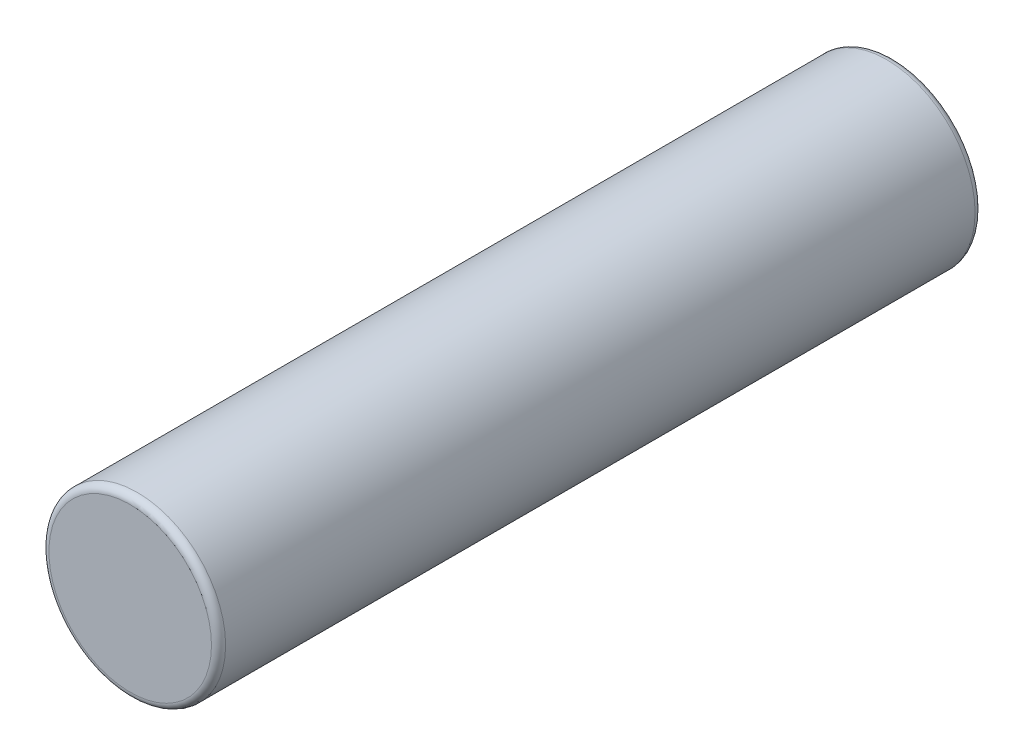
from build123d import *

# Parameters (mm, degrees)
SKETCH1_R      = 12.495
EXTRUDE1_DEPTH = 108
FILLET1_R      = 1


with BuildPart() as part:
    # Sketch1 → Extrude1 (new body)
    with BuildSketch(Plane.XY):
        Circle(SKETCH1_R)
    extrude(amount=EXTRUDE1_DEPTH)

    # Fillet1
    fillet1_edges = [part.edges().sort_by_distance(p)[0] for p in [
        (-12.495, 0, 0),
        (-12.495, 0, 108),
    ]]
    fillet(fillet1_edges, radius=FILLET1_R)


solid = part.part
